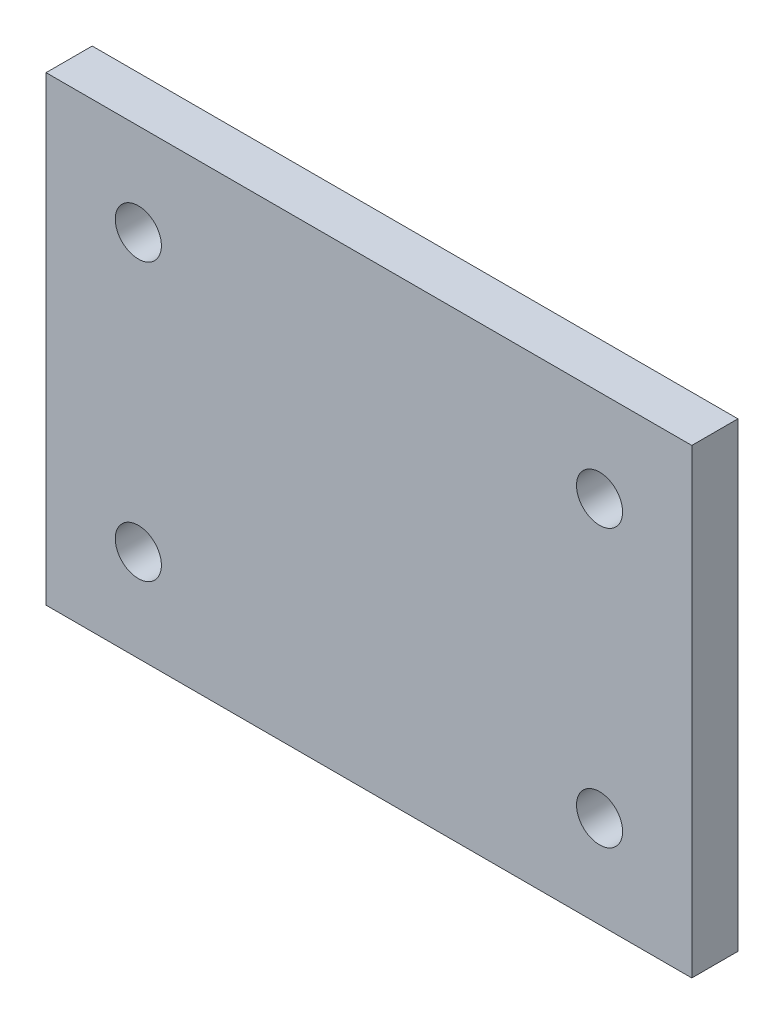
ISO-10303-21;
HEADER;
FILE_DESCRIPTION(('STEP AP214'),'2;1');
FILE_NAME('part.step','',(''),(''),'','','');
FILE_SCHEMA(('AUTOMOTIVE_DESIGN { 1 0 10303 214 1 1 1 1 }'));
ENDSEC;
DATA;
#1=APPLICATION_CONTEXT('core data for automotive mechanical design processes');
#2=APPLICATION_PROTOCOL_DEFINITION('international standard','automotive_design',2000,#1);
#3=PRODUCT_CONTEXT('',#1,'mechanical');
#4=PRODUCT('Part','Part','',(#3));
#5=PRODUCT_RELATED_PRODUCT_CATEGORY('part','',(#4));
#6=PRODUCT_DEFINITION_FORMATION('','',#4);
#7=PRODUCT_DEFINITION_CONTEXT('part definition',#1,'design');
#8=PRODUCT_DEFINITION('design','',#6,#7);
#9=PRODUCT_DEFINITION_SHAPE('','',#8);
#10=(LENGTH_UNIT() NAMED_UNIT(*) SI_UNIT(.MILLI.,.METRE.));
#11=(NAMED_UNIT(*) PLANE_ANGLE_UNIT() SI_UNIT($,.RADIAN.));
#12=(NAMED_UNIT(*) SI_UNIT($,.STERADIAN.) SOLID_ANGLE_UNIT());
#13=UNCERTAINTY_MEASURE_WITH_UNIT(LENGTH_MEASURE(1.E-05),#10,'distance_accuracy_value','');
#14=(GEOMETRIC_REPRESENTATION_CONTEXT(3) GLOBAL_UNCERTAINTY_ASSIGNED_CONTEXT((#13)) GLOBAL_UNIT_ASSIGNED_CONTEXT((#10,
#11,#12)) REPRESENTATION_CONTEXT('',''));
#15=CARTESIAN_POINT('',(0.,0.,0.));
#16=DIRECTION('',(0.,0.,1.));
#17=DIRECTION('',(1.,0.,0.));
#18=AXIS2_PLACEMENT_3D('',#15,#16,#17);
#19=CARTESIAN_POINT('',(0.,0.,5.));
#20=DIRECTION('',(1.,0.,0.));
#21=DIRECTION('',(0.,0.,-1.));
#22=AXIS2_PLACEMENT_3D('',#19,#20,#21);
#23=PLANE('',#22);
#24=DIRECTION('',(0.,-1.,0.));
#25=VECTOR('',#24,1.);
#26=CARTESIAN_POINT('',(0.,0.,0.));
#27=LINE('',#26,#25);
#28=CARTESIAN_POINT('',(0.,50.,0.));
#29=VERTEX_POINT('',#28);
#30=CARTESIAN_POINT('',(0.,0.,0.));
#31=VERTEX_POINT('',#30);
#32=EDGE_CURVE('E120',#29,#31,#27,.T.);
#33=ORIENTED_EDGE('',*,*,#32,.T.);
#34=DIRECTION('',(0.,0.,-1.));
#35=VECTOR('',#34,1.);
#36=CARTESIAN_POINT('',(0.,0.,5.));
#37=LINE('',#36,#35);
#38=CARTESIAN_POINT('',(0.,0.,5.));
#39=VERTEX_POINT('',#38);
#40=EDGE_CURVE('E11',#39,#31,#37,.T.);
#41=ORIENTED_EDGE('',*,*,#40,.F.);
#42=DIRECTION('',(0.,-1.,0.));
#43=VECTOR('',#42,1.);
#44=CARTESIAN_POINT('',(0.,0.,5.));
#45=LINE('',#44,#43);
#46=CARTESIAN_POINT('',(0.,50.,5.));
#47=VERTEX_POINT('',#46);
#48=EDGE_CURVE('E103',#47,#39,#45,.T.);
#49=ORIENTED_EDGE('',*,*,#48,.F.);
#50=DIRECTION('',(0.,0.,-1.));
#51=VECTOR('',#50,1.);
#52=CARTESIAN_POINT('',(0.,50.,5.));
#53=LINE('',#52,#51);
#54=EDGE_CURVE('E116',#47,#29,#53,.T.);
#55=ORIENTED_EDGE('',*,*,#54,.T.);
#56=EDGE_LOOP('',(#33,#41,#49,#55));
#57=FACE_BOUND('',#56,.T.);
#58=ADVANCED_FACE('F43',(#57),#23,.F.);
#59=CARTESIAN_POINT('',(0.,0.,5.));
#60=DIRECTION('',(0.,1.,0.));
#61=DIRECTION('',(0.,0.,1.));
#62=AXIS2_PLACEMENT_3D('',#59,#60,#61);
#63=PLANE('',#62);
#64=DIRECTION('',(1.,0.,0.));
#65=VECTOR('',#64,1.);
#66=CARTESIAN_POINT('',(0.,0.,0.));
#67=LINE('',#66,#65);
#68=CARTESIAN_POINT('',(70.,0.,0.));
#69=VERTEX_POINT('',#68);
#70=EDGE_CURVE('E108',#31,#69,#67,.T.);
#71=ORIENTED_EDGE('',*,*,#70,.T.);
#72=DIRECTION('',(0.,0.,-1.));
#73=VECTOR('',#72,1.);
#74=CARTESIAN_POINT('',(70.,0.,5.));
#75=LINE('',#74,#73);
#76=CARTESIAN_POINT('',(70.,0.,5.));
#77=VERTEX_POINT('',#76);
#78=EDGE_CURVE('E52',#77,#69,#75,.T.);
#79=ORIENTED_EDGE('',*,*,#78,.F.);
#80=DIRECTION('',(1.,0.,0.));
#81=VECTOR('',#80,1.);
#82=CARTESIAN_POINT('',(0.,0.,5.));
#83=LINE('',#82,#81);
#84=EDGE_CURVE('E97',#39,#77,#83,.T.);
#85=ORIENTED_EDGE('',*,*,#84,.F.);
#86=ORIENTED_EDGE('',*,*,#40,.T.);
#87=EDGE_LOOP('',(#71,#79,#85,#86));
#88=FACE_BOUND('',#87,.T.);
#89=ADVANCED_FACE('F107',(#88),#63,.F.);
#90=CARTESIAN_POINT('',(70.,0.,5.));
#91=DIRECTION('',(-1.,0.,0.));
#92=DIRECTION('',(0.,0.,1.));
#93=AXIS2_PLACEMENT_3D('',#90,#91,#92);
#94=PLANE('',#93);
#95=DIRECTION('',(0.,1.,0.));
#96=VECTOR('',#95,1.);
#97=CARTESIAN_POINT('',(70.,0.,0.));
#98=LINE('',#97,#96);
#99=CARTESIAN_POINT('',(70.,50.,0.));
#100=VERTEX_POINT('',#99);
#101=EDGE_CURVE('E83',#69,#100,#98,.T.);
#102=ORIENTED_EDGE('',*,*,#101,.T.);
#103=DIRECTION('',(0.,0.,-1.));
#104=VECTOR('',#103,1.);
#105=CARTESIAN_POINT('',(70.,50.,5.));
#106=LINE('',#105,#104);
#107=CARTESIAN_POINT('',(70.,50.,5.));
#108=VERTEX_POINT('',#107);
#109=EDGE_CURVE('E110',#108,#100,#106,.T.);
#110=ORIENTED_EDGE('',*,*,#109,.F.);
#111=DIRECTION('',(0.,1.,0.));
#112=VECTOR('',#111,1.);
#113=CARTESIAN_POINT('',(70.,0.,5.));
#114=LINE('',#113,#112);
#115=EDGE_CURVE('E101',#77,#108,#114,.T.);
#116=ORIENTED_EDGE('',*,*,#115,.F.);
#117=ORIENTED_EDGE('',*,*,#78,.T.);
#118=EDGE_LOOP('',(#102,#110,#116,#117));
#119=FACE_BOUND('',#118,.T.);
#120=ADVANCED_FACE('F111',(#119),#94,.F.);
#121=CARTESIAN_POINT('',(0.,50.,5.));
#122=DIRECTION('',(0.,-1.,0.));
#123=DIRECTION('',(0.,0.,-1.));
#124=AXIS2_PLACEMENT_3D('',#121,#122,#123);
#125=PLANE('',#124);
#126=DIRECTION('',(-1.,0.,0.));
#127=VECTOR('',#126,1.);
#128=CARTESIAN_POINT('',(0.,50.,0.));
#129=LINE('',#128,#127);
#130=EDGE_CURVE('E89',#100,#29,#129,.T.);
#131=ORIENTED_EDGE('',*,*,#130,.T.);
#132=ORIENTED_EDGE('',*,*,#54,.F.);
#133=DIRECTION('',(-1.,0.,0.));
#134=VECTOR('',#133,1.);
#135=CARTESIAN_POINT('',(0.,50.,5.));
#136=LINE('',#135,#134);
#137=EDGE_CURVE('E63',#108,#47,#136,.T.);
#138=ORIENTED_EDGE('',*,*,#137,.F.);
#139=ORIENTED_EDGE('',*,*,#109,.T.);
#140=EDGE_LOOP('',(#131,#132,#138,#139));
#141=FACE_BOUND('',#140,.T.);
#142=ADVANCED_FACE('F135',(#141),#125,.F.);
#143=CARTESIAN_POINT('',(0.,50.,5.));
#144=DIRECTION('',(0.,0.,-1.));
#145=DIRECTION('',(-1.,0.,0.));
#146=AXIS2_PLACEMENT_3D('',#143,#144,#145);
#147=PLANE('',#146);
#148=CARTESIAN_POINT('',(10.,10.,5.));
#149=DIRECTION('',(0.,0.,1.));
#150=DIRECTION('',(1.,0.,0.));
#151=AXIS2_PLACEMENT_3D('',#148,#149,#150);
#152=CIRCLE('',#151,2.5);
#153=CARTESIAN_POINT('',(12.5,10.,5.));
#154=VERTEX_POINT('',#153);
#155=EDGE_CURVE('E164',#154,#154,#152,.T.);
#156=ORIENTED_EDGE('',*,*,#155,.F.);
#157=EDGE_LOOP('',(#156));
#158=FACE_BOUND('',#157,.T.);
#159=CARTESIAN_POINT('',(60.,10.,5.));
#160=DIRECTION('',(0.,0.,1.));
#161=DIRECTION('',(1.,0.,0.));
#162=AXIS2_PLACEMENT_3D('',#159,#160,#161);
#163=CIRCLE('',#162,2.49999999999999);
#164=CARTESIAN_POINT('',(62.5,10.,5.));
#165=VERTEX_POINT('',#164);
#166=EDGE_CURVE('E157',#165,#165,#163,.T.);
#167=ORIENTED_EDGE('',*,*,#166,.F.);
#168=EDGE_LOOP('',(#167));
#169=FACE_BOUND('',#168,.T.);
#170=CARTESIAN_POINT('',(60.,40.,5.));
#171=DIRECTION('',(0.,0.,1.));
#172=DIRECTION('',(1.,0.,0.));
#173=AXIS2_PLACEMENT_3D('',#170,#171,#172);
#174=CIRCLE('',#173,2.5);
#175=CARTESIAN_POINT('',(62.5,40.,5.));
#176=VERTEX_POINT('',#175);
#177=EDGE_CURVE('E150',#176,#176,#174,.T.);
#178=ORIENTED_EDGE('',*,*,#177,.F.);
#179=EDGE_LOOP('',(#178));
#180=FACE_BOUND('',#179,.T.);
#181=CARTESIAN_POINT('',(10.,40.,5.));
#182=DIRECTION('',(0.,0.,1.));
#183=DIRECTION('',(1.,0.,0.));
#184=AXIS2_PLACEMENT_3D('',#181,#182,#183);
#185=CIRCLE('',#184,2.5);
#186=CARTESIAN_POINT('',(12.5,40.,5.));
#187=VERTEX_POINT('',#186);
#188=EDGE_CURVE('E143',#187,#187,#185,.T.);
#189=ORIENTED_EDGE('',*,*,#188,.F.);
#190=EDGE_LOOP('',(#189));
#191=FACE_BOUND('',#190,.T.);
#192=ORIENTED_EDGE('',*,*,#48,.T.);
#193=ORIENTED_EDGE('',*,*,#84,.T.);
#194=ORIENTED_EDGE('',*,*,#115,.T.);
#195=ORIENTED_EDGE('',*,*,#137,.T.);
#196=EDGE_LOOP('',(#192,#193,#194,#195));
#197=FACE_BOUND('',#196,.T.);
#198=ADVANCED_FACE('F99',(#158,#169,#180,#191,#197),#147,.F.);
#199=CARTESIAN_POINT('',(0.,50.,0.));
#200=DIRECTION('',(0.,0.,-1.));
#201=DIRECTION('',(-1.,0.,0.));
#202=AXIS2_PLACEMENT_3D('',#199,#200,#201);
#203=PLANE('',#202);
#204=CARTESIAN_POINT('',(10.,10.,0.));
#205=DIRECTION('',(0.,0.,1.));
#206=DIRECTION('',(1.,0.,0.));
#207=AXIS2_PLACEMENT_3D('',#204,#205,#206);
#208=CIRCLE('',#207,2.5);
#209=CARTESIAN_POINT('',(12.5,10.,0.));
#210=VERTEX_POINT('',#209);
#211=EDGE_CURVE('E161',#210,#210,#208,.T.);
#212=ORIENTED_EDGE('',*,*,#211,.T.);
#213=EDGE_LOOP('',(#212));
#214=FACE_BOUND('',#213,.T.);
#215=CARTESIAN_POINT('',(60.,10.,0.));
#216=DIRECTION('',(0.,0.,1.));
#217=DIRECTION('',(1.,0.,0.));
#218=AXIS2_PLACEMENT_3D('',#215,#216,#217);
#219=CIRCLE('',#218,2.49999999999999);
#220=CARTESIAN_POINT('',(62.5,10.,0.));
#221=VERTEX_POINT('',#220);
#222=EDGE_CURVE('E153',#221,#221,#219,.T.);
#223=ORIENTED_EDGE('',*,*,#222,.T.);
#224=EDGE_LOOP('',(#223));
#225=FACE_BOUND('',#224,.T.);
#226=CARTESIAN_POINT('',(60.,40.,0.));
#227=DIRECTION('',(0.,0.,1.));
#228=DIRECTION('',(1.,0.,0.));
#229=AXIS2_PLACEMENT_3D('',#226,#227,#228);
#230=CIRCLE('',#229,2.5);
#231=CARTESIAN_POINT('',(62.5,40.,0.));
#232=VERTEX_POINT('',#231);
#233=EDGE_CURVE('E147',#232,#232,#230,.T.);
#234=ORIENTED_EDGE('',*,*,#233,.T.);
#235=EDGE_LOOP('',(#234));
#236=FACE_BOUND('',#235,.T.);
#237=CARTESIAN_POINT('',(10.,40.,0.));
#238=DIRECTION('',(0.,0.,1.));
#239=DIRECTION('',(1.,0.,0.));
#240=AXIS2_PLACEMENT_3D('',#237,#238,#239);
#241=CIRCLE('',#240,2.5);
#242=CARTESIAN_POINT('',(12.5,40.,0.));
#243=VERTEX_POINT('',#242);
#244=EDGE_CURVE('E124',#243,#243,#241,.T.);
#245=ORIENTED_EDGE('',*,*,#244,.T.);
#246=EDGE_LOOP('',(#245));
#247=FACE_BOUND('',#246,.T.);
#248=ORIENTED_EDGE('',*,*,#32,.F.);
#249=ORIENTED_EDGE('',*,*,#130,.F.);
#250=ORIENTED_EDGE('',*,*,#101,.F.);
#251=ORIENTED_EDGE('',*,*,#70,.F.);
#252=EDGE_LOOP('',(#248,#249,#250,#251));
#253=FACE_BOUND('',#252,.T.);
#254=ADVANCED_FACE('F138',(#214,#225,#236,#247,#253),#203,.T.);
#255=CARTESIAN_POINT('',(10.,40.,0.));
#256=DIRECTION('',(0.,0.,1.));
#257=DIRECTION('',(1.,0.,0.));
#258=AXIS2_PLACEMENT_3D('',#255,#256,#257);
#259=CYLINDRICAL_SURFACE('',#258,2.5);
#260=ORIENTED_EDGE('',*,*,#244,.F.);
#261=EDGE_LOOP('',(#260));
#262=FACE_BOUND('',#261,.T.);
#263=ORIENTED_EDGE('',*,*,#188,.T.);
#264=EDGE_LOOP('',(#263));
#265=FACE_BOUND('',#264,.T.);
#266=ADVANCED_FACE('F190',(#262,#265),#259,.F.);
#267=CARTESIAN_POINT('',(60.,40.,0.));
#268=DIRECTION('',(0.,0.,1.));
#269=DIRECTION('',(1.,0.,0.));
#270=AXIS2_PLACEMENT_3D('',#267,#268,#269);
#271=CYLINDRICAL_SURFACE('',#270,2.5);
#272=ORIENTED_EDGE('',*,*,#233,.F.);
#273=EDGE_LOOP('',(#272));
#274=FACE_BOUND('',#273,.T.);
#275=ORIENTED_EDGE('',*,*,#177,.T.);
#276=EDGE_LOOP('',(#275));
#277=FACE_BOUND('',#276,.T.);
#278=ADVANCED_FACE('F192',(#274,#277),#271,.F.);
#279=CARTESIAN_POINT('',(60.,10.,0.));
#280=DIRECTION('',(0.,0.,1.));
#281=DIRECTION('',(1.,0.,0.));
#282=AXIS2_PLACEMENT_3D('',#279,#280,#281);
#283=CYLINDRICAL_SURFACE('',#282,2.49999999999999);
#284=ORIENTED_EDGE('',*,*,#222,.F.);
#285=EDGE_LOOP('',(#284));
#286=FACE_BOUND('',#285,.T.);
#287=ORIENTED_EDGE('',*,*,#166,.T.);
#288=EDGE_LOOP('',(#287));
#289=FACE_BOUND('',#288,.T.);
#290=ADVANCED_FACE('F177',(#286,#289),#283,.F.);
#291=CARTESIAN_POINT('',(10.,10.,0.));
#292=DIRECTION('',(0.,0.,1.));
#293=DIRECTION('',(1.,0.,0.));
#294=AXIS2_PLACEMENT_3D('',#291,#292,#293);
#295=CYLINDRICAL_SURFACE('',#294,2.5);
#296=ORIENTED_EDGE('',*,*,#211,.F.);
#297=EDGE_LOOP('',(#296));
#298=FACE_BOUND('',#297,.T.);
#299=ORIENTED_EDGE('',*,*,#155,.T.);
#300=EDGE_LOOP('',(#299));
#301=FACE_BOUND('',#300,.T.);
#302=ADVANCED_FACE('F174',(#298,#301),#295,.F.);
#303=CLOSED_SHELL('',(#58,#89,#120,#142,#198,#254,#266,#278,#290,#302));
#304=MANIFOLD_SOLID_BREP('B2',#303);
#305=ADVANCED_BREP_SHAPE_REPRESENTATION('',(#18,#304),#14);
#306=SHAPE_DEFINITION_REPRESENTATION(#9,#305);
ENDSEC;
END-ISO-10303-21;
